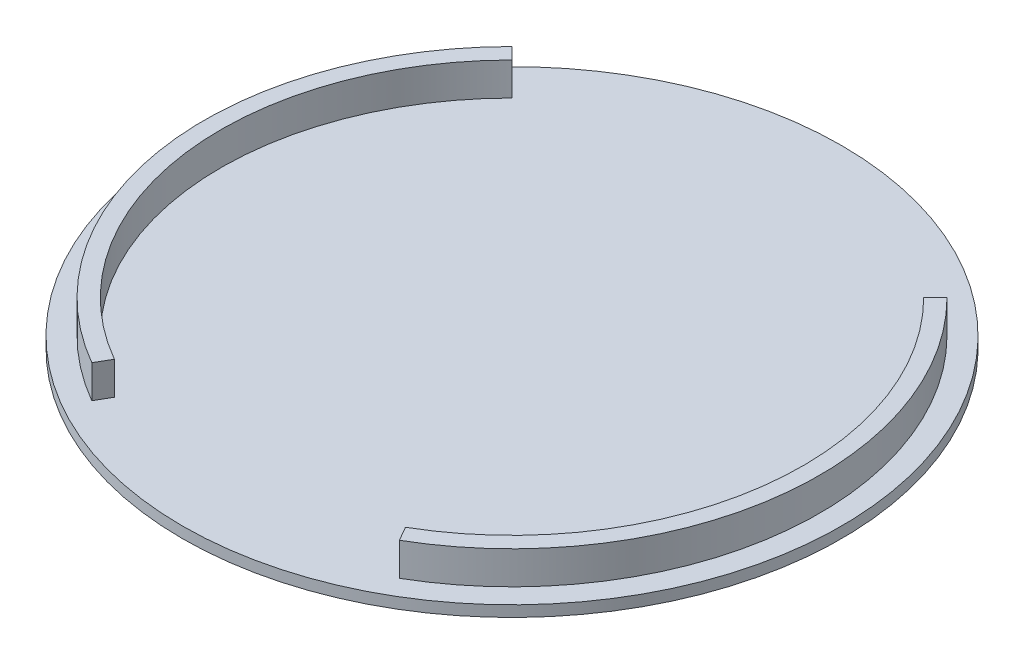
ISO-10303-21;
HEADER;
FILE_DESCRIPTION(('STEP AP214'),'2;1');
FILE_NAME('part.step','',(''),(''),'','','');
FILE_SCHEMA(('AUTOMOTIVE_DESIGN { 1 0 10303 214 1 1 1 1 }'));
ENDSEC;
DATA;
#1=APPLICATION_CONTEXT('core data for automotive mechanical design processes');
#2=APPLICATION_PROTOCOL_DEFINITION('international standard','automotive_design',2000,#1);
#3=PRODUCT_CONTEXT('',#1,'mechanical');
#4=PRODUCT('Part','Part','',(#3));
#5=PRODUCT_RELATED_PRODUCT_CATEGORY('part','',(#4));
#6=PRODUCT_DEFINITION_FORMATION('','',#4);
#7=PRODUCT_DEFINITION_CONTEXT('part definition',#1,'design');
#8=PRODUCT_DEFINITION('design','',#6,#7);
#9=PRODUCT_DEFINITION_SHAPE('','',#8);
#10=(LENGTH_UNIT() NAMED_UNIT(*) SI_UNIT(.MILLI.,.METRE.));
#11=(NAMED_UNIT(*) PLANE_ANGLE_UNIT() SI_UNIT($,.RADIAN.));
#12=(NAMED_UNIT(*) SI_UNIT($,.STERADIAN.) SOLID_ANGLE_UNIT());
#13=UNCERTAINTY_MEASURE_WITH_UNIT(LENGTH_MEASURE(1.E-05),#10,'distance_accuracy_value','');
#14=(GEOMETRIC_REPRESENTATION_CONTEXT(3) GLOBAL_UNCERTAINTY_ASSIGNED_CONTEXT((#13)) GLOBAL_UNIT_ASSIGNED_CONTEXT((#10,
#11,#12)) REPRESENTATION_CONTEXT('',''));
#15=CARTESIAN_POINT('',(0.,0.,0.));
#16=DIRECTION('',(0.,0.,1.));
#17=DIRECTION('',(1.,0.,0.));
#18=AXIS2_PLACEMENT_3D('',#15,#16,#17);
#19=CARTESIAN_POINT('',(0.,2.,0.));
#20=DIRECTION('',(0.,1.,0.));
#21=DIRECTION('',(0.,0.,1.));
#22=AXIS2_PLACEMENT_3D('',#19,#20,#21);
#23=PLANE('',#22);
#24=CARTESIAN_POINT('',(0.,2.,0.));
#25=DIRECTION('',(0.,1.,0.));
#26=DIRECTION('',(0.,0.,1.));
#27=AXIS2_PLACEMENT_3D('',#24,#25,#26);
#28=CIRCLE('',#27,60.);
#29=CARTESIAN_POINT('',(0.,2.,60.));
#30=VERTEX_POINT('',#29);
#31=EDGE_CURVE('E11',#30,#30,#28,.T.);
#32=ORIENTED_EDGE('',*,*,#31,.T.);
#33=EDGE_LOOP('',(#32));
#34=FACE_BOUND('',#33,.T.);
#35=DIRECTION('',(-0.707106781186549,0.,0.707106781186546));
#36=VECTOR('',#35,1.);
#37=CARTESIAN_POINT('',(37.4766594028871,2.,-37.476659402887));
#38=LINE('',#37,#36);
#39=CARTESIAN_POINT('',(39.5979797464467,2.,-39.5979797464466));
#40=VERTEX_POINT('',#39);
#41=CARTESIAN_POINT('',(37.4766594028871,2.,-37.476659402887));
#42=VERTEX_POINT('',#41);
#43=EDGE_CURVE('E369',#40,#42,#38,.T.);
#44=ORIENTED_EDGE('',*,*,#43,.F.);
#45=CARTESIAN_POINT('',(0.,2.,0.));
#46=DIRECTION('',(0.,1.,0.));
#47=DIRECTION('',(0.,0.,-1.));
#48=AXIS2_PLACEMENT_3D('',#45,#46,#47);
#49=CIRCLE('',#48,56.);
#50=CARTESIAN_POINT('',(27.9999999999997,2.,48.4974226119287));
#51=VERTEX_POINT('',#50);
#52=EDGE_CURVE('E355',#51,#40,#49,.T.);
#53=ORIENTED_EDGE('',*,*,#52,.F.);
#54=DIRECTION('',(0.499999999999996,0.,0.866025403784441));
#55=VECTOR('',#54,1.);
#56=CARTESIAN_POINT('',(26.4999999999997,2.,45.8993464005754));
#57=LINE('',#56,#55);
#58=CARTESIAN_POINT('',(26.4999999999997,2.,45.8993464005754));
#59=VERTEX_POINT('',#58);
#60=EDGE_CURVE('E360',#59,#51,#57,.T.);
#61=ORIENTED_EDGE('',*,*,#60,.F.);
#62=CARTESIAN_POINT('',(0.,2.,0.));
#63=DIRECTION('',(0.,-1.,0.));
#64=DIRECTION('',(0.,0.,-1.));
#65=AXIS2_PLACEMENT_3D('',#62,#63,#64);
#66=CIRCLE('',#65,53.);
#67=EDGE_CURVE('E371',#42,#59,#66,.T.);
#68=ORIENTED_EDGE('',*,*,#67,.F.);
#69=EDGE_LOOP('',(#44,#53,#61,#68));
#70=FACE_BOUND('',#69,.T.);
#71=DIRECTION('',(0.499999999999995,0.,-0.866025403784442));
#72=VECTOR('',#71,1.);
#73=CARTESIAN_POINT('',(-27.9999999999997,2.,48.4974226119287));
#74=LINE('',#73,#72);
#75=CARTESIAN_POINT('',(-27.9999999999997,2.,48.4974226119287));
#76=VERTEX_POINT('',#75);
#77=CARTESIAN_POINT('',(-26.4999999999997,2.,45.8993464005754));
#78=VERTEX_POINT('',#77);
#79=EDGE_CURVE('E340',#76,#78,#74,.T.);
#80=ORIENTED_EDGE('',*,*,#79,.F.);
#81=CARTESIAN_POINT('',(0.,2.,0.));
#82=DIRECTION('',(0.,1.,0.));
#83=DIRECTION('',(0.,0.,1.));
#84=AXIS2_PLACEMENT_3D('',#81,#82,#83);
#85=CIRCLE('',#84,56.);
#86=CARTESIAN_POINT('',(-39.5979797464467,2.,-39.5979797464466));
#87=VERTEX_POINT('',#86);
#88=EDGE_CURVE('E320',#87,#76,#85,.T.);
#89=ORIENTED_EDGE('',*,*,#88,.F.);
#90=DIRECTION('',(-0.707106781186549,0.,-0.707106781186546));
#91=VECTOR('',#90,1.);
#92=CARTESIAN_POINT('',(-39.5979797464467,2.,-39.5979797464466));
#93=LINE('',#92,#91);
#94=CARTESIAN_POINT('',(-37.4766594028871,2.,-37.4766594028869));
#95=VERTEX_POINT('',#94);
#96=EDGE_CURVE('E331',#95,#87,#93,.T.);
#97=ORIENTED_EDGE('',*,*,#96,.F.);
#98=CARTESIAN_POINT('',(0.,2.,0.));
#99=DIRECTION('',(0.,-1.,0.));
#100=DIRECTION('',(0.,0.,1.));
#101=AXIS2_PLACEMENT_3D('',#98,#99,#100);
#102=CIRCLE('',#101,53.);
#103=EDGE_CURVE('E342',#78,#95,#102,.T.);
#104=ORIENTED_EDGE('',*,*,#103,.F.);
#105=EDGE_LOOP('',(#80,#89,#97,#104));
#106=FACE_BOUND('',#105,.T.);
#107=ADVANCED_FACE('F33',(#34,#70,#106),#23,.T.);
#108=CARTESIAN_POINT('',(0.,2.,0.));
#109=DIRECTION('',(0.,-1.,0.));
#110=DIRECTION('',(0.,0.,-1.));
#111=AXIS2_PLACEMENT_3D('',#108,#109,#110);
#112=CYLINDRICAL_SURFACE('',#111,60.);
#113=ORIENTED_EDGE('',*,*,#31,.F.);
#114=EDGE_LOOP('',(#113));
#115=FACE_BOUND('',#114,.T.);
#116=CARTESIAN_POINT('',(0.,0.,0.));
#117=DIRECTION('',(0.,1.,0.));
#118=DIRECTION('',(0.,0.,1.));
#119=AXIS2_PLACEMENT_3D('',#116,#117,#118);
#120=CIRCLE('',#119,60.);
#121=CARTESIAN_POINT('',(0.,0.,60.));
#122=VERTEX_POINT('',#121);
#123=EDGE_CURVE('E37',#122,#122,#120,.T.);
#124=ORIENTED_EDGE('',*,*,#123,.T.);
#125=EDGE_LOOP('',(#124));
#126=FACE_BOUND('',#125,.T.);
#127=ADVANCED_FACE('F35',(#115,#126),#112,.T.);
#128=CARTESIAN_POINT('',(0.,0.,0.));
#129=DIRECTION('',(0.,1.,0.));
#130=DIRECTION('',(0.,0.,1.));
#131=AXIS2_PLACEMENT_3D('',#128,#129,#130);
#132=PLANE('',#131);
#133=DIRECTION('',(1.,0.,0.));
#134=VECTOR('',#133,1.);
#135=CARTESIAN_POINT('',(28.,0.,28.));
#136=LINE('',#135,#134);
#137=CARTESIAN_POINT('',(28.,0.,28.));
#138=VERTEX_POINT('',#137);
#139=CARTESIAN_POINT('',(38.,0.,28.));
#140=VERTEX_POINT('',#139);
#141=EDGE_CURVE('E223',#138,#140,#136,.T.);
#142=ORIENTED_EDGE('',*,*,#141,.F.);
#143=DIRECTION('',(0.,0.,-1.));
#144=VECTOR('',#143,1.);
#145=CARTESIAN_POINT('',(28.,0.,38.));
#146=LINE('',#145,#144);
#147=CARTESIAN_POINT('',(28.,0.,38.));
#148=VERTEX_POINT('',#147);
#149=EDGE_CURVE('E48',#148,#138,#146,.T.);
#150=ORIENTED_EDGE('',*,*,#149,.F.);
#151=DIRECTION('',(-1.,0.,0.));
#152=VECTOR('',#151,1.);
#153=CARTESIAN_POINT('',(28.,0.,38.));
#154=LINE('',#153,#152);
#155=CARTESIAN_POINT('',(38.,0.,38.));
#156=VERTEX_POINT('',#155);
#157=EDGE_CURVE('E214',#156,#148,#154,.T.);
#158=ORIENTED_EDGE('',*,*,#157,.F.);
#159=DIRECTION('',(0.,0.,1.));
#160=VECTOR('',#159,1.);
#161=CARTESIAN_POINT('',(38.,0.,38.));
#162=LINE('',#161,#160);
#163=EDGE_CURVE('E217',#140,#156,#162,.T.);
#164=ORIENTED_EDGE('',*,*,#163,.F.);
#165=EDGE_LOOP('',(#142,#150,#158,#164));
#166=FACE_BOUND('',#165,.T.);
#167=DIRECTION('',(-1.,0.,0.));
#168=VECTOR('',#167,1.);
#169=CARTESIAN_POINT('',(38.,0.,-28.));
#170=LINE('',#169,#168);
#171=CARTESIAN_POINT('',(38.,0.,-28.));
#172=VERTEX_POINT('',#171);
#173=CARTESIAN_POINT('',(28.,0.,-28.));
#174=VERTEX_POINT('',#173);
#175=EDGE_CURVE('E249',#172,#174,#170,.T.);
#176=ORIENTED_EDGE('',*,*,#175,.F.);
#177=DIRECTION('',(0.,0.,1.));
#178=VECTOR('',#177,1.);
#179=CARTESIAN_POINT('',(38.,0.,-28.));
#180=LINE('',#179,#178);
#181=CARTESIAN_POINT('',(38.,0.,-38.));
#182=VERTEX_POINT('',#181);
#183=EDGE_CURVE('E56',#182,#172,#180,.T.);
#184=ORIENTED_EDGE('',*,*,#183,.F.);
#185=DIRECTION('',(1.,0.,0.));
#186=VECTOR('',#185,1.);
#187=CARTESIAN_POINT('',(38.,0.,-38.));
#188=LINE('',#187,#186);
#189=CARTESIAN_POINT('',(28.,0.,-38.));
#190=VERTEX_POINT('',#189);
#191=EDGE_CURVE('E238',#190,#182,#188,.T.);
#192=ORIENTED_EDGE('',*,*,#191,.F.);
#193=DIRECTION('',(0.,0.,-1.));
#194=VECTOR('',#193,1.);
#195=CARTESIAN_POINT('',(28.,0.,-28.));
#196=LINE('',#195,#194);
#197=EDGE_CURVE('E253',#174,#190,#196,.T.);
#198=ORIENTED_EDGE('',*,*,#197,.F.);
#199=EDGE_LOOP('',(#176,#184,#192,#198));
#200=FACE_BOUND('',#199,.T.);
#201=DIRECTION('',(-1.,0.,0.));
#202=VECTOR('',#201,1.);
#203=CARTESIAN_POINT('',(-28.,0.,-28.));
#204=LINE('',#203,#202);
#205=CARTESIAN_POINT('',(-28.,0.,-28.));
#206=VERTEX_POINT('',#205);
#207=CARTESIAN_POINT('',(-38.,0.,-28.));
#208=VERTEX_POINT('',#207);
#209=EDGE_CURVE('E280',#206,#208,#204,.T.);
#210=ORIENTED_EDGE('',*,*,#209,.F.);
#211=DIRECTION('',(0.,0.,1.));
#212=VECTOR('',#211,1.);
#213=CARTESIAN_POINT('',(-28.,0.,-38.));
#214=LINE('',#213,#212);
#215=CARTESIAN_POINT('',(-28.,0.,-38.));
#216=VERTEX_POINT('',#215);
#217=EDGE_CURVE('E278',#216,#206,#214,.T.);
#218=ORIENTED_EDGE('',*,*,#217,.F.);
#219=DIRECTION('',(1.,0.,0.));
#220=VECTOR('',#219,1.);
#221=CARTESIAN_POINT('',(-28.,0.,-38.));
#222=LINE('',#221,#220);
#223=CARTESIAN_POINT('',(-38.,0.,-38.));
#224=VERTEX_POINT('',#223);
#225=EDGE_CURVE('E268',#224,#216,#222,.T.);
#226=ORIENTED_EDGE('',*,*,#225,.F.);
#227=DIRECTION('',(0.,0.,-1.));
#228=VECTOR('',#227,1.);
#229=CARTESIAN_POINT('',(-38.,0.,-38.));
#230=LINE('',#229,#228);
#231=EDGE_CURVE('E283',#208,#224,#230,.T.);
#232=ORIENTED_EDGE('',*,*,#231,.F.);
#233=EDGE_LOOP('',(#210,#218,#226,#232));
#234=FACE_BOUND('',#233,.T.);
#235=DIRECTION('',(1.,0.,0.));
#236=VECTOR('',#235,1.);
#237=CARTESIAN_POINT('',(-38.,0.,28.));
#238=LINE('',#237,#236);
#239=CARTESIAN_POINT('',(-38.,0.,28.));
#240=VERTEX_POINT('',#239);
#241=CARTESIAN_POINT('',(-28.,0.,28.));
#242=VERTEX_POINT('',#241);
#243=EDGE_CURVE('E310',#240,#242,#238,.T.);
#244=ORIENTED_EDGE('',*,*,#243,.F.);
#245=DIRECTION('',(0.,0.,-1.));
#246=VECTOR('',#245,1.);
#247=CARTESIAN_POINT('',(-38.,0.,38.));
#248=LINE('',#247,#246);
#249=CARTESIAN_POINT('',(-38.,0.,38.));
#250=VERTEX_POINT('',#249);
#251=EDGE_CURVE('E230',#250,#240,#248,.T.);
#252=ORIENTED_EDGE('',*,*,#251,.F.);
#253=DIRECTION('',(-1.,0.,0.));
#254=VECTOR('',#253,1.);
#255=CARTESIAN_POINT('',(-38.,0.,38.));
#256=LINE('',#255,#254);
#257=CARTESIAN_POINT('',(-28.,0.,38.));
#258=VERTEX_POINT('',#257);
#259=EDGE_CURVE('E299',#258,#250,#256,.T.);
#260=ORIENTED_EDGE('',*,*,#259,.F.);
#261=DIRECTION('',(0.,0.,1.));
#262=VECTOR('',#261,1.);
#263=CARTESIAN_POINT('',(-28.,0.,38.));
#264=LINE('',#263,#262);
#265=EDGE_CURVE('E313',#242,#258,#264,.T.);
#266=ORIENTED_EDGE('',*,*,#265,.F.);
#267=EDGE_LOOP('',(#244,#252,#260,#266));
#268=FACE_BOUND('',#267,.T.);
#269=ORIENTED_EDGE('',*,*,#123,.F.);
#270=EDGE_LOOP('',(#269));
#271=FACE_BOUND('',#270,.T.);
#272=ADVANCED_FACE('F389',(#166,#200,#234,#268,#271),#132,.F.);
#273=CARTESIAN_POINT('',(0.,8.,0.));
#274=DIRECTION('',(0.,-1.,0.));
#275=DIRECTION('',(0.,0.,-1.));
#276=AXIS2_PLACEMENT_3D('',#273,#274,#275);
#277=CYLINDRICAL_SURFACE('',#276,56.);
#278=ORIENTED_EDGE('',*,*,#52,.T.);
#279=DIRECTION('',(0.,-1.,0.));
#280=VECTOR('',#279,1.);
#281=CARTESIAN_POINT('',(39.5979797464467,8.,-39.5979797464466));
#282=LINE('',#281,#280);
#283=CARTESIAN_POINT('',(39.5979797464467,8.,-39.5979797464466));
#284=VERTEX_POINT('',#283);
#285=EDGE_CURVE('E382',#284,#40,#282,.T.);
#286=ORIENTED_EDGE('',*,*,#285,.F.);
#287=CARTESIAN_POINT('',(0.,8.,0.));
#288=DIRECTION('',(0.,1.,0.));
#289=DIRECTION('',(0.,0.,-1.));
#290=AXIS2_PLACEMENT_3D('',#287,#288,#289);
#291=CIRCLE('',#290,56.);
#292=CARTESIAN_POINT('',(27.9999999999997,8.,48.4974226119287));
#293=VERTEX_POINT('',#292);
#294=EDGE_CURVE('E356',#293,#284,#291,.T.);
#295=ORIENTED_EDGE('',*,*,#294,.F.);
#296=DIRECTION('',(0.,-1.,0.));
#297=VECTOR('',#296,1.);
#298=CARTESIAN_POINT('',(27.9999999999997,8.,48.4974226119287));
#299=LINE('',#298,#297);
#300=EDGE_CURVE('E366',#293,#51,#299,.T.);
#301=ORIENTED_EDGE('',*,*,#300,.T.);
#302=EDGE_LOOP('',(#278,#286,#295,#301));
#303=FACE_BOUND('',#302,.T.);
#304=ADVANCED_FACE('F391',(#303),#277,.T.);
#305=CARTESIAN_POINT('',(37.4766594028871,8.,-37.476659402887));
#306=DIRECTION('',(0.707106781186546,0.,0.707106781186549));
#307=DIRECTION('',(0.707106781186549,0.,-0.707106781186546));
#308=AXIS2_PLACEMENT_3D('',#305,#306,#307);
#309=PLANE('',#308);
#310=ORIENTED_EDGE('',*,*,#43,.T.);
#311=DIRECTION('',(0.,-1.,0.));
#312=VECTOR('',#311,1.);
#313=CARTESIAN_POINT('',(37.4766594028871,8.,-37.476659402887));
#314=LINE('',#313,#312);
#315=CARTESIAN_POINT('',(37.4766594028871,8.,-37.476659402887));
#316=VERTEX_POINT('',#315);
#317=EDGE_CURVE('E379',#316,#42,#314,.T.);
#318=ORIENTED_EDGE('',*,*,#317,.F.);
#319=DIRECTION('',(-0.707106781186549,0.,0.707106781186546));
#320=VECTOR('',#319,1.);
#321=CARTESIAN_POINT('',(37.4766594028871,8.,-37.476659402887));
#322=LINE('',#321,#320);
#323=EDGE_CURVE('E359',#284,#316,#322,.T.);
#324=ORIENTED_EDGE('',*,*,#323,.F.);
#325=ORIENTED_EDGE('',*,*,#285,.T.);
#326=EDGE_LOOP('',(#310,#318,#324,#325));
#327=FACE_BOUND('',#326,.T.);
#328=ADVANCED_FACE('F397',(#327),#309,.F.);
#329=CARTESIAN_POINT('',(0.,8.,0.));
#330=DIRECTION('',(0.,-1.,0.));
#331=DIRECTION('',(0.,0.,-1.));
#332=AXIS2_PLACEMENT_3D('',#329,#330,#331);
#333=CYLINDRICAL_SURFACE('',#332,53.);
#334=ORIENTED_EDGE('',*,*,#67,.T.);
#335=DIRECTION('',(0.,-1.,0.));
#336=VECTOR('',#335,1.);
#337=CARTESIAN_POINT('',(26.4999999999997,8.,45.8993464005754));
#338=LINE('',#337,#336);
#339=CARTESIAN_POINT('',(26.4999999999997,8.,45.8993464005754));
#340=VERTEX_POINT('',#339);
#341=EDGE_CURVE('E377',#340,#59,#338,.T.);
#342=ORIENTED_EDGE('',*,*,#341,.F.);
#343=CARTESIAN_POINT('',(0.,8.,0.));
#344=DIRECTION('',(0.,-1.,0.));
#345=DIRECTION('',(0.,0.,-1.));
#346=AXIS2_PLACEMENT_3D('',#343,#344,#345);
#347=CIRCLE('',#346,53.);
#348=EDGE_CURVE('E362',#316,#340,#347,.T.);
#349=ORIENTED_EDGE('',*,*,#348,.F.);
#350=ORIENTED_EDGE('',*,*,#317,.T.);
#351=EDGE_LOOP('',(#334,#342,#349,#350));
#352=FACE_BOUND('',#351,.T.);
#353=ADVANCED_FACE('F411',(#352),#333,.F.);
#354=CARTESIAN_POINT('',(26.4999999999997,8.,45.8993464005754));
#355=DIRECTION('',(0.866025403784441,0.,-0.499999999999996));
#356=DIRECTION('',(-0.499999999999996,0.,-0.866025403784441));
#357=AXIS2_PLACEMENT_3D('',#354,#355,#356);
#358=PLANE('',#357);
#359=ORIENTED_EDGE('',*,*,#60,.T.);
#360=ORIENTED_EDGE('',*,*,#300,.F.);
#361=DIRECTION('',(0.499999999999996,0.,0.866025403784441));
#362=VECTOR('',#361,1.);
#363=CARTESIAN_POINT('',(26.4999999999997,8.,45.8993464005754));
#364=LINE('',#363,#362);
#365=EDGE_CURVE('E364',#340,#293,#364,.T.);
#366=ORIENTED_EDGE('',*,*,#365,.F.);
#367=ORIENTED_EDGE('',*,*,#341,.T.);
#368=EDGE_LOOP('',(#359,#360,#366,#367));
#369=FACE_BOUND('',#368,.T.);
#370=ADVANCED_FACE('F414',(#369),#358,.F.);
#371=CARTESIAN_POINT('',(0.,8.,0.));
#372=DIRECTION('',(0.,-1.,0.));
#373=DIRECTION('',(0.,0.,-1.));
#374=AXIS2_PLACEMENT_3D('',#371,#372,#373);
#375=PLANE('',#374);
#376=ORIENTED_EDGE('',*,*,#294,.T.);
#377=ORIENTED_EDGE('',*,*,#323,.T.);
#378=ORIENTED_EDGE('',*,*,#348,.T.);
#379=ORIENTED_EDGE('',*,*,#365,.T.);
#380=EDGE_LOOP('',(#376,#377,#378,#379));
#381=FACE_BOUND('',#380,.T.);
#382=ADVANCED_FACE('F418',(#381),#375,.F.);
#383=CARTESIAN_POINT('',(0.,8.,0.));
#384=DIRECTION('',(0.,-1.,0.));
#385=DIRECTION('',(0.,0.,-1.));
#386=AXIS2_PLACEMENT_3D('',#383,#384,#385);
#387=CYLINDRICAL_SURFACE('',#386,56.);
#388=ORIENTED_EDGE('',*,*,#88,.T.);
#389=DIRECTION('',(0.,-1.,0.));
#390=VECTOR('',#389,1.);
#391=CARTESIAN_POINT('',(-27.9999999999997,8.,48.4974226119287));
#392=LINE('',#391,#390);
#393=CARTESIAN_POINT('',(-27.9999999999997,8.,48.4974226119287));
#394=VERTEX_POINT('',#393);
#395=EDGE_CURVE('E353',#394,#76,#392,.T.);
#396=ORIENTED_EDGE('',*,*,#395,.F.);
#397=CARTESIAN_POINT('',(0.,8.,0.));
#398=DIRECTION('',(0.,1.,0.));
#399=DIRECTION('',(0.,0.,1.));
#400=AXIS2_PLACEMENT_3D('',#397,#398,#399);
#401=CIRCLE('',#400,56.);
#402=CARTESIAN_POINT('',(-39.5979797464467,8.,-39.5979797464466));
#403=VERTEX_POINT('',#402);
#404=EDGE_CURVE('E327',#403,#394,#401,.T.);
#405=ORIENTED_EDGE('',*,*,#404,.F.);
#406=DIRECTION('',(0.,-1.,0.));
#407=VECTOR('',#406,1.);
#408=CARTESIAN_POINT('',(-39.5979797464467,8.,-39.5979797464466));
#409=LINE('',#408,#407);
#410=EDGE_CURVE('E337',#403,#87,#409,.T.);
#411=ORIENTED_EDGE('',*,*,#410,.T.);
#412=EDGE_LOOP('',(#388,#396,#405,#411));
#413=FACE_BOUND('',#412,.T.);
#414=ADVANCED_FACE('F422',(#413),#387,.T.);
#415=CARTESIAN_POINT('',(-27.9999999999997,8.,48.4974226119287));
#416=DIRECTION('',(-0.866025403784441,0.,-0.499999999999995));
#417=DIRECTION('',(-0.499999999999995,0.,0.866025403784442));
#418=AXIS2_PLACEMENT_3D('',#415,#416,#417);
#419=PLANE('',#418);
#420=ORIENTED_EDGE('',*,*,#79,.T.);
#421=DIRECTION('',(0.,-1.,0.));
#422=VECTOR('',#421,1.);
#423=CARTESIAN_POINT('',(-26.4999999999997,8.,45.8993464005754));
#424=LINE('',#423,#422);
#425=CARTESIAN_POINT('',(-26.4999999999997,8.,45.8993464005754));
#426=VERTEX_POINT('',#425);
#427=EDGE_CURVE('E350',#426,#78,#424,.T.);
#428=ORIENTED_EDGE('',*,*,#427,.F.);
#429=DIRECTION('',(0.499999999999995,0.,-0.866025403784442));
#430=VECTOR('',#429,1.);
#431=CARTESIAN_POINT('',(-27.9999999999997,8.,48.4974226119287));
#432=LINE('',#431,#430);
#433=EDGE_CURVE('E330',#394,#426,#432,.T.);
#434=ORIENTED_EDGE('',*,*,#433,.F.);
#435=ORIENTED_EDGE('',*,*,#395,.T.);
#436=EDGE_LOOP('',(#420,#428,#434,#435));
#437=FACE_BOUND('',#436,.T.);
#438=ADVANCED_FACE('F426',(#437),#419,.F.);
#439=CARTESIAN_POINT('',(0.,8.,0.));
#440=DIRECTION('',(0.,-1.,0.));
#441=DIRECTION('',(0.,0.,-1.));
#442=AXIS2_PLACEMENT_3D('',#439,#440,#441);
#443=CYLINDRICAL_SURFACE('',#442,53.);
#444=ORIENTED_EDGE('',*,*,#103,.T.);
#445=DIRECTION('',(0.,-1.,0.));
#446=VECTOR('',#445,1.);
#447=CARTESIAN_POINT('',(-37.4766594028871,8.,-37.4766594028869));
#448=LINE('',#447,#446);
#449=CARTESIAN_POINT('',(-37.4766594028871,8.,-37.4766594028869));
#450=VERTEX_POINT('',#449);
#451=EDGE_CURVE('E348',#450,#95,#448,.T.);
#452=ORIENTED_EDGE('',*,*,#451,.F.);
#453=CARTESIAN_POINT('',(0.,8.,0.));
#454=DIRECTION('',(0.,-1.,0.));
#455=DIRECTION('',(0.,0.,1.));
#456=AXIS2_PLACEMENT_3D('',#453,#454,#455);
#457=CIRCLE('',#456,53.);
#458=EDGE_CURVE('E333',#426,#450,#457,.T.);
#459=ORIENTED_EDGE('',*,*,#458,.F.);
#460=ORIENTED_EDGE('',*,*,#427,.T.);
#461=EDGE_LOOP('',(#444,#452,#459,#460));
#462=FACE_BOUND('',#461,.T.);
#463=ADVANCED_FACE('F430',(#462),#443,.F.);
#464=CARTESIAN_POINT('',(-39.5979797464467,8.,-39.5979797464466));
#465=DIRECTION('',(-0.707106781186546,0.,0.707106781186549));
#466=DIRECTION('',(0.707106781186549,0.,0.707106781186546));
#467=AXIS2_PLACEMENT_3D('',#464,#465,#466);
#468=PLANE('',#467);
#469=ORIENTED_EDGE('',*,*,#96,.T.);
#470=ORIENTED_EDGE('',*,*,#410,.F.);
#471=DIRECTION('',(-0.707106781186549,0.,-0.707106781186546));
#472=VECTOR('',#471,1.);
#473=CARTESIAN_POINT('',(-39.5979797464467,8.,-39.5979797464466));
#474=LINE('',#473,#472);
#475=EDGE_CURVE('E335',#450,#403,#474,.T.);
#476=ORIENTED_EDGE('',*,*,#475,.F.);
#477=ORIENTED_EDGE('',*,*,#451,.T.);
#478=EDGE_LOOP('',(#469,#470,#476,#477));
#479=FACE_BOUND('',#478,.T.);
#480=ADVANCED_FACE('F434',(#479),#468,.F.);
#481=CARTESIAN_POINT('',(0.,8.,0.));
#482=DIRECTION('',(0.,1.,0.));
#483=DIRECTION('',(0.,0.,1.));
#484=AXIS2_PLACEMENT_3D('',#481,#482,#483);
#485=PLANE('',#484);
#486=ORIENTED_EDGE('',*,*,#404,.T.);
#487=ORIENTED_EDGE('',*,*,#433,.T.);
#488=ORIENTED_EDGE('',*,*,#458,.T.);
#489=ORIENTED_EDGE('',*,*,#475,.T.);
#490=EDGE_LOOP('',(#486,#487,#488,#489));
#491=FACE_BOUND('',#490,.T.);
#492=ADVANCED_FACE('F438',(#491),#485,.T.);
#493=CARTESIAN_POINT('',(-38.,1.,38.));
#494=DIRECTION('',(-1.,0.,0.));
#495=DIRECTION('',(0.,0.,1.));
#496=AXIS2_PLACEMENT_3D('',#493,#494,#495);
#497=PLANE('',#496);
#498=ORIENTED_EDGE('',*,*,#251,.T.);
#499=DIRECTION('',(0.,-1.,0.));
#500=VECTOR('',#499,1.);
#501=CARTESIAN_POINT('',(-38.,1.,28.));
#502=LINE('',#501,#500);
#503=CARTESIAN_POINT('',(-38.,1.,28.));
#504=VERTEX_POINT('',#503);
#505=EDGE_CURVE('E308',#504,#240,#502,.T.);
#506=ORIENTED_EDGE('',*,*,#505,.F.);
#507=DIRECTION('',(0.,0.,-1.));
#508=VECTOR('',#507,1.);
#509=CARTESIAN_POINT('',(-38.,1.,38.));
#510=LINE('',#509,#508);
#511=CARTESIAN_POINT('',(-38.,1.,38.));
#512=VERTEX_POINT('',#511);
#513=EDGE_CURVE('E295',#512,#504,#510,.T.);
#514=ORIENTED_EDGE('',*,*,#513,.F.);
#515=DIRECTION('',(0.,-1.,0.));
#516=VECTOR('',#515,1.);
#517=CARTESIAN_POINT('',(-38.,1.,38.));
#518=LINE('',#517,#516);
#519=EDGE_CURVE('E318',#512,#250,#518,.T.);
#520=ORIENTED_EDGE('',*,*,#519,.T.);
#521=EDGE_LOOP('',(#498,#506,#514,#520));
#522=FACE_BOUND('',#521,.T.);
#523=ADVANCED_FACE('F442',(#522),#497,.F.);
#524=CARTESIAN_POINT('',(-38.,1.,38.));
#525=DIRECTION('',(0.,0.,1.));
#526=DIRECTION('',(1.,0.,0.));
#527=AXIS2_PLACEMENT_3D('',#524,#525,#526);
#528=PLANE('',#527);
#529=ORIENTED_EDGE('',*,*,#259,.T.);
#530=ORIENTED_EDGE('',*,*,#519,.F.);
#531=DIRECTION('',(-1.,0.,0.));
#532=VECTOR('',#531,1.);
#533=CARTESIAN_POINT('',(-38.,1.,38.));
#534=LINE('',#533,#532);
#535=CARTESIAN_POINT('',(-28.,1.,38.));
#536=VERTEX_POINT('',#535);
#537=EDGE_CURVE('E305',#536,#512,#534,.T.);
#538=ORIENTED_EDGE('',*,*,#537,.F.);
#539=DIRECTION('',(0.,-1.,0.));
#540=VECTOR('',#539,1.);
#541=CARTESIAN_POINT('',(-28.,1.,38.));
#542=LINE('',#541,#540);
#543=EDGE_CURVE('E321',#536,#258,#542,.T.);
#544=ORIENTED_EDGE('',*,*,#543,.T.);
#545=EDGE_LOOP('',(#529,#530,#538,#544));
#546=FACE_BOUND('',#545,.T.);
#547=ADVANCED_FACE('F446',(#546),#528,.F.);
#548=CARTESIAN_POINT('',(-28.,1.,38.));
#549=DIRECTION('',(1.,0.,0.));
#550=DIRECTION('',(0.,0.,-1.));
#551=AXIS2_PLACEMENT_3D('',#548,#549,#550);
#552=PLANE('',#551);
#553=ORIENTED_EDGE('',*,*,#265,.T.);
#554=ORIENTED_EDGE('',*,*,#543,.F.);
#555=DIRECTION('',(0.,0.,1.));
#556=VECTOR('',#555,1.);
#557=CARTESIAN_POINT('',(-28.,1.,38.));
#558=LINE('',#557,#556);
#559=CARTESIAN_POINT('',(-28.,1.,28.));
#560=VERTEX_POINT('',#559);
#561=EDGE_CURVE('E302',#560,#536,#558,.T.);
#562=ORIENTED_EDGE('',*,*,#561,.F.);
#563=DIRECTION('',(0.,-1.,0.));
#564=VECTOR('',#563,1.);
#565=CARTESIAN_POINT('',(-28.,1.,28.));
#566=LINE('',#565,#564);
#567=EDGE_CURVE('E323',#560,#242,#566,.T.);
#568=ORIENTED_EDGE('',*,*,#567,.T.);
#569=EDGE_LOOP('',(#553,#554,#562,#568));
#570=FACE_BOUND('',#569,.T.);
#571=ADVANCED_FACE('F452',(#570),#552,.F.);
#572=CARTESIAN_POINT('',(-38.,1.,28.));
#573=DIRECTION('',(0.,0.,-1.));
#574=DIRECTION('',(-1.,0.,0.));
#575=AXIS2_PLACEMENT_3D('',#572,#573,#574);
#576=PLANE('',#575);
#577=ORIENTED_EDGE('',*,*,#243,.T.);
#578=ORIENTED_EDGE('',*,*,#567,.F.);
#579=DIRECTION('',(1.,0.,0.));
#580=VECTOR('',#579,1.);
#581=CARTESIAN_POINT('',(-38.,1.,28.));
#582=LINE('',#581,#580);
#583=EDGE_CURVE('E298',#504,#560,#582,.T.);
#584=ORIENTED_EDGE('',*,*,#583,.F.);
#585=ORIENTED_EDGE('',*,*,#505,.T.);
#586=EDGE_LOOP('',(#577,#578,#584,#585));
#587=FACE_BOUND('',#586,.T.);
#588=ADVANCED_FACE('F448',(#587),#576,.F.);
#589=CARTESIAN_POINT('',(0.,1.,0.));
#590=DIRECTION('',(0.,-1.,0.));
#591=DIRECTION('',(0.,0.,-1.));
#592=AXIS2_PLACEMENT_3D('',#589,#590,#591);
#593=PLANE('',#592);
#594=ORIENTED_EDGE('',*,*,#513,.T.);
#595=ORIENTED_EDGE('',*,*,#583,.T.);
#596=ORIENTED_EDGE('',*,*,#561,.T.);
#597=ORIENTED_EDGE('',*,*,#537,.T.);
#598=EDGE_LOOP('',(#594,#595,#596,#597));
#599=FACE_BOUND('',#598,.T.);
#600=ADVANCED_FACE('F451',(#599),#593,.T.);
#601=CARTESIAN_POINT('',(-28.,1.,-38.));
#602=DIRECTION('',(1.,0.,0.));
#603=DIRECTION('',(0.,0.,-1.));
#604=AXIS2_PLACEMENT_3D('',#601,#602,#603);
#605=PLANE('',#604);
#606=ORIENTED_EDGE('',*,*,#217,.T.);
#607=DIRECTION('',(0.,-1.,0.));
#608=VECTOR('',#607,1.);
#609=CARTESIAN_POINT('',(-28.,1.,-28.));
#610=LINE('',#609,#608);
#611=CARTESIAN_POINT('',(-28.,1.,-28.));
#612=VERTEX_POINT('',#611);
#613=EDGE_CURVE('E277',#612,#206,#610,.T.);
#614=ORIENTED_EDGE('',*,*,#613,.F.);
#615=DIRECTION('',(0.,0.,1.));
#616=VECTOR('',#615,1.);
#617=CARTESIAN_POINT('',(-28.,1.,-38.));
#618=LINE('',#617,#616);
#619=CARTESIAN_POINT('',(-28.,1.,-38.));
#620=VERTEX_POINT('',#619);
#621=EDGE_CURVE('E264',#620,#612,#618,.T.);
#622=ORIENTED_EDGE('',*,*,#621,.F.);
#623=DIRECTION('',(0.,-1.,0.));
#624=VECTOR('',#623,1.);
#625=CARTESIAN_POINT('',(-28.,1.,-38.));
#626=LINE('',#625,#624);
#627=EDGE_CURVE('E250',#620,#216,#626,.T.);
#628=ORIENTED_EDGE('',*,*,#627,.T.);
#629=EDGE_LOOP('',(#606,#614,#622,#628));
#630=FACE_BOUND('',#629,.T.);
#631=ADVANCED_FACE('F462',(#630),#605,.F.);
#632=CARTESIAN_POINT('',(-28.,1.,-38.));
#633=DIRECTION('',(0.,0.,-1.));
#634=DIRECTION('',(-1.,0.,0.));
#635=AXIS2_PLACEMENT_3D('',#632,#633,#634);
#636=PLANE('',#635);
#637=ORIENTED_EDGE('',*,*,#225,.T.);
#638=ORIENTED_EDGE('',*,*,#627,.F.);
#639=DIRECTION('',(1.,0.,0.));
#640=VECTOR('',#639,1.);
#641=CARTESIAN_POINT('',(-28.,1.,-38.));
#642=LINE('',#641,#640);
#643=CARTESIAN_POINT('',(-38.,1.,-38.));
#644=VERTEX_POINT('',#643);
#645=EDGE_CURVE('E274',#644,#620,#642,.T.);
#646=ORIENTED_EDGE('',*,*,#645,.F.);
#647=DIRECTION('',(0.,-1.,0.));
#648=VECTOR('',#647,1.);
#649=CARTESIAN_POINT('',(-38.,1.,-38.));
#650=LINE('',#649,#648);
#651=EDGE_CURVE('E289',#644,#224,#650,.T.);
#652=ORIENTED_EDGE('',*,*,#651,.T.);
#653=EDGE_LOOP('',(#637,#638,#646,#652));
#654=FACE_BOUND('',#653,.T.);
#655=ADVANCED_FACE('F466',(#654),#636,.F.);
#656=CARTESIAN_POINT('',(-38.,1.,-38.));
#657=DIRECTION('',(-1.,0.,0.));
#658=DIRECTION('',(0.,0.,1.));
#659=AXIS2_PLACEMENT_3D('',#656,#657,#658);
#660=PLANE('',#659);
#661=ORIENTED_EDGE('',*,*,#231,.T.);
#662=ORIENTED_EDGE('',*,*,#651,.F.);
#663=DIRECTION('',(0.,0.,-1.));
#664=VECTOR('',#663,1.);
#665=CARTESIAN_POINT('',(-38.,1.,-38.));
#666=LINE('',#665,#664);
#667=CARTESIAN_POINT('',(-38.,1.,-28.));
#668=VERTEX_POINT('',#667);
#669=EDGE_CURVE('E271',#668,#644,#666,.T.);
#670=ORIENTED_EDGE('',*,*,#669,.F.);
#671=DIRECTION('',(0.,-1.,0.));
#672=VECTOR('',#671,1.);
#673=CARTESIAN_POINT('',(-38.,1.,-28.));
#674=LINE('',#673,#672);
#675=EDGE_CURVE('E291',#668,#208,#674,.T.);
#676=ORIENTED_EDGE('',*,*,#675,.T.);
#677=EDGE_LOOP('',(#661,#662,#670,#676));
#678=FACE_BOUND('',#677,.T.);
#679=ADVANCED_FACE('F472',(#678),#660,.F.);
#680=CARTESIAN_POINT('',(-28.,1.,-28.));
#681=DIRECTION('',(0.,0.,1.));
#682=DIRECTION('',(1.,0.,0.));
#683=AXIS2_PLACEMENT_3D('',#680,#681,#682);
#684=PLANE('',#683);
#685=ORIENTED_EDGE('',*,*,#209,.T.);
#686=ORIENTED_EDGE('',*,*,#675,.F.);
#687=DIRECTION('',(-1.,0.,0.));
#688=VECTOR('',#687,1.);
#689=CARTESIAN_POINT('',(-28.,1.,-28.));
#690=LINE('',#689,#688);
#691=EDGE_CURVE('E267',#612,#668,#690,.T.);
#692=ORIENTED_EDGE('',*,*,#691,.F.);
#693=ORIENTED_EDGE('',*,*,#613,.T.);
#694=EDGE_LOOP('',(#685,#686,#692,#693));
#695=FACE_BOUND('',#694,.T.);
#696=ADVANCED_FACE('F468',(#695),#684,.F.);
#697=CARTESIAN_POINT('',(0.,1.,0.));
#698=DIRECTION('',(0.,-1.,0.));
#699=DIRECTION('',(0.,0.,-1.));
#700=AXIS2_PLACEMENT_3D('',#697,#698,#699);
#701=PLANE('',#700);
#702=ORIENTED_EDGE('',*,*,#621,.T.);
#703=ORIENTED_EDGE('',*,*,#691,.T.);
#704=ORIENTED_EDGE('',*,*,#669,.T.);
#705=ORIENTED_EDGE('',*,*,#645,.T.);
#706=EDGE_LOOP('',(#702,#703,#704,#705));
#707=FACE_BOUND('',#706,.T.);
#708=ADVANCED_FACE('F471',(#707),#701,.T.);
#709=CARTESIAN_POINT('',(38.,1.,-28.));
#710=DIRECTION('',(1.,0.,0.));
#711=DIRECTION('',(0.,0.,-1.));
#712=AXIS2_PLACEMENT_3D('',#709,#710,#711);
#713=PLANE('',#712);
#714=ORIENTED_EDGE('',*,*,#183,.T.);
#715=DIRECTION('',(0.,-1.,0.));
#716=VECTOR('',#715,1.);
#717=CARTESIAN_POINT('',(38.,1.,-28.));
#718=LINE('',#717,#716);
#719=CARTESIAN_POINT('',(38.,1.,-28.));
#720=VERTEX_POINT('',#719);
#721=EDGE_CURVE('E247',#720,#172,#718,.T.);
#722=ORIENTED_EDGE('',*,*,#721,.F.);
#723=DIRECTION('',(0.,0.,1.));
#724=VECTOR('',#723,1.);
#725=CARTESIAN_POINT('',(38.,1.,-28.));
#726=LINE('',#725,#724);
#727=CARTESIAN_POINT('',(38.,1.,-38.));
#728=VERTEX_POINT('',#727);
#729=EDGE_CURVE('E234',#728,#720,#726,.T.);
#730=ORIENTED_EDGE('',*,*,#729,.F.);
#731=DIRECTION('',(0.,-1.,0.));
#732=VECTOR('',#731,1.);
#733=CARTESIAN_POINT('',(38.,1.,-38.));
#734=LINE('',#733,#732);
#735=EDGE_CURVE('E224',#728,#182,#734,.T.);
#736=ORIENTED_EDGE('',*,*,#735,.T.);
#737=EDGE_LOOP('',(#714,#722,#730,#736));
#738=FACE_BOUND('',#737,.T.);
#739=ADVANCED_FACE('F482',(#738),#713,.F.);
#740=CARTESIAN_POINT('',(38.,1.,-38.));
#741=DIRECTION('',(0.,0.,-1.));
#742=DIRECTION('',(-1.,0.,0.));
#743=AXIS2_PLACEMENT_3D('',#740,#741,#742);
#744=PLANE('',#743);
#745=ORIENTED_EDGE('',*,*,#191,.T.);
#746=ORIENTED_EDGE('',*,*,#735,.F.);
#747=DIRECTION('',(1.,0.,0.));
#748=VECTOR('',#747,1.);
#749=CARTESIAN_POINT('',(38.,1.,-38.));
#750=LINE('',#749,#748);
#751=CARTESIAN_POINT('',(28.,1.,-38.));
#752=VERTEX_POINT('',#751);
#753=EDGE_CURVE('E244',#752,#728,#750,.T.);
#754=ORIENTED_EDGE('',*,*,#753,.F.);
#755=DIRECTION('',(0.,-1.,0.));
#756=VECTOR('',#755,1.);
#757=CARTESIAN_POINT('',(28.,1.,-38.));
#758=LINE('',#757,#756);
#759=EDGE_CURVE('E259',#752,#190,#758,.T.);
#760=ORIENTED_EDGE('',*,*,#759,.T.);
#761=EDGE_LOOP('',(#745,#746,#754,#760));
#762=FACE_BOUND('',#761,.T.);
#763=ADVANCED_FACE('F486',(#762),#744,.F.);
#764=CARTESIAN_POINT('',(28.,1.,-28.));
#765=DIRECTION('',(-1.,0.,0.));
#766=DIRECTION('',(0.,0.,1.));
#767=AXIS2_PLACEMENT_3D('',#764,#765,#766);
#768=PLANE('',#767);
#769=ORIENTED_EDGE('',*,*,#197,.T.);
#770=ORIENTED_EDGE('',*,*,#759,.F.);
#771=DIRECTION('',(0.,0.,-1.));
#772=VECTOR('',#771,1.);
#773=CARTESIAN_POINT('',(28.,1.,-28.));
#774=LINE('',#773,#772);
#775=CARTESIAN_POINT('',(28.,1.,-28.));
#776=VERTEX_POINT('',#775);
#777=EDGE_CURVE('E241',#776,#752,#774,.T.);
#778=ORIENTED_EDGE('',*,*,#777,.F.);
#779=DIRECTION('',(0.,-1.,0.));
#780=VECTOR('',#779,1.);
#781=CARTESIAN_POINT('',(28.,1.,-28.));
#782=LINE('',#781,#780);
#783=EDGE_CURVE('E261',#776,#174,#782,.T.);
#784=ORIENTED_EDGE('',*,*,#783,.T.);
#785=EDGE_LOOP('',(#769,#770,#778,#784));
#786=FACE_BOUND('',#785,.T.);
#787=ADVANCED_FACE('F491',(#786),#768,.F.);
#788=CARTESIAN_POINT('',(38.,1.,-28.));
#789=DIRECTION('',(0.,0.,1.));
#790=DIRECTION('',(1.,0.,0.));
#791=AXIS2_PLACEMENT_3D('',#788,#789,#790);
#792=PLANE('',#791);
#793=ORIENTED_EDGE('',*,*,#175,.T.);
#794=ORIENTED_EDGE('',*,*,#783,.F.);
#795=DIRECTION('',(-1.,0.,0.));
#796=VECTOR('',#795,1.);
#797=CARTESIAN_POINT('',(38.,1.,-28.));
#798=LINE('',#797,#796);
#799=EDGE_CURVE('E237',#720,#776,#798,.T.);
#800=ORIENTED_EDGE('',*,*,#799,.F.);
#801=ORIENTED_EDGE('',*,*,#721,.T.);
#802=EDGE_LOOP('',(#793,#794,#800,#801));
#803=FACE_BOUND('',#802,.T.);
#804=ADVANCED_FACE('F487',(#803),#792,.F.);
#805=CARTESIAN_POINT('',(0.,1.,0.));
#806=DIRECTION('',(0.,1.,0.));
#807=DIRECTION('',(0.,0.,1.));
#808=AXIS2_PLACEMENT_3D('',#805,#806,#807);
#809=PLANE('',#808);
#810=ORIENTED_EDGE('',*,*,#729,.T.);
#811=ORIENTED_EDGE('',*,*,#799,.T.);
#812=ORIENTED_EDGE('',*,*,#777,.T.);
#813=ORIENTED_EDGE('',*,*,#753,.T.);
#814=EDGE_LOOP('',(#810,#811,#812,#813));
#815=FACE_BOUND('',#814,.T.);
#816=ADVANCED_FACE('F490',(#815),#809,.F.);
#817=CARTESIAN_POINT('',(28.,1.,38.));
#818=DIRECTION('',(-1.,0.,0.));
#819=DIRECTION('',(0.,0.,1.));
#820=AXIS2_PLACEMENT_3D('',#817,#818,#819);
#821=PLANE('',#820);
#822=ORIENTED_EDGE('',*,*,#149,.T.);
#823=DIRECTION('',(0.,-1.,0.));
#824=VECTOR('',#823,1.);
#825=CARTESIAN_POINT('',(28.,1.,28.));
#826=LINE('',#825,#824);
#827=CARTESIAN_POINT('',(28.,1.,28.));
#828=VERTEX_POINT('',#827);
#829=EDGE_CURVE('E192',#828,#138,#826,.T.);
#830=ORIENTED_EDGE('',*,*,#829,.F.);
#831=DIRECTION('',(0.,0.,-1.));
#832=VECTOR('',#831,1.);
#833=CARTESIAN_POINT('',(28.,1.,38.));
#834=LINE('',#833,#832);
#835=CARTESIAN_POINT('',(28.,1.,38.));
#836=VERTEX_POINT('',#835);
#837=EDGE_CURVE('E196',#836,#828,#834,.T.);
#838=ORIENTED_EDGE('',*,*,#837,.F.);
#839=DIRECTION('',(0.,-1.,0.));
#840=VECTOR('',#839,1.);
#841=CARTESIAN_POINT('',(28.,1.,38.));
#842=LINE('',#841,#840);
#843=EDGE_CURVE('E228',#836,#148,#842,.T.);
#844=ORIENTED_EDGE('',*,*,#843,.T.);
#845=EDGE_LOOP('',(#822,#830,#838,#844));
#846=FACE_BOUND('',#845,.T.);
#847=ADVANCED_FACE('F194',(#846),#821,.F.);
#848=CARTESIAN_POINT('',(28.,1.,38.));
#849=DIRECTION('',(0.,0.,1.));
#850=DIRECTION('',(1.,0.,0.));
#851=AXIS2_PLACEMENT_3D('',#848,#849,#850);
#852=PLANE('',#851);
#853=ORIENTED_EDGE('',*,*,#157,.T.);
#854=ORIENTED_EDGE('',*,*,#843,.F.);
#855=DIRECTION('',(-1.,0.,0.));
#856=VECTOR('',#855,1.);
#857=CARTESIAN_POINT('',(28.,1.,38.));
#858=LINE('',#857,#856);
#859=CARTESIAN_POINT('',(38.,1.,38.));
#860=VERTEX_POINT('',#859);
#861=EDGE_CURVE('E202',#860,#836,#858,.T.);
#862=ORIENTED_EDGE('',*,*,#861,.F.);
#863=DIRECTION('',(0.,-1.,0.));
#864=VECTOR('',#863,1.);
#865=CARTESIAN_POINT('',(38.,1.,38.));
#866=LINE('',#865,#864);
#867=EDGE_CURVE('E231',#860,#156,#866,.T.);
#868=ORIENTED_EDGE('',*,*,#867,.T.);
#869=EDGE_LOOP('',(#853,#854,#862,#868));
#870=FACE_BOUND('',#869,.T.);
#871=ADVANCED_FACE('F504',(#870),#852,.F.);
#872=CARTESIAN_POINT('',(38.,1.,38.));
#873=DIRECTION('',(1.,0.,0.));
#874=DIRECTION('',(0.,0.,-1.));
#875=AXIS2_PLACEMENT_3D('',#872,#873,#874);
#876=PLANE('',#875);
#877=ORIENTED_EDGE('',*,*,#163,.T.);
#878=ORIENTED_EDGE('',*,*,#867,.F.);
#879=DIRECTION('',(0.,0.,1.));
#880=VECTOR('',#879,1.);
#881=CARTESIAN_POINT('',(38.,1.,38.));
#882=LINE('',#881,#880);
#883=CARTESIAN_POINT('',(38.,1.,28.));
#884=VERTEX_POINT('',#883);
#885=EDGE_CURVE('E210',#884,#860,#882,.T.);
#886=ORIENTED_EDGE('',*,*,#885,.F.);
#887=DIRECTION('',(0.,-1.,0.));
#888=VECTOR('',#887,1.);
#889=CARTESIAN_POINT('',(38.,1.,28.));
#890=LINE('',#889,#888);
#891=EDGE_CURVE('E201',#884,#140,#890,.T.);
#892=ORIENTED_EDGE('',*,*,#891,.T.);
#893=EDGE_LOOP('',(#877,#878,#886,#892));
#894=FACE_BOUND('',#893,.T.);
#895=ADVANCED_FACE('F507',(#894),#876,.F.);
#896=CARTESIAN_POINT('',(28.,1.,28.));
#897=DIRECTION('',(0.,0.,-1.));
#898=DIRECTION('',(-1.,0.,0.));
#899=AXIS2_PLACEMENT_3D('',#896,#897,#898);
#900=PLANE('',#899);
#901=ORIENTED_EDGE('',*,*,#141,.T.);
#902=ORIENTED_EDGE('',*,*,#891,.F.);
#903=DIRECTION('',(1.,0.,0.));
#904=VECTOR('',#903,1.);
#905=CARTESIAN_POINT('',(28.,1.,28.));
#906=LINE('',#905,#904);
#907=EDGE_CURVE('E205',#828,#884,#906,.T.);
#908=ORIENTED_EDGE('',*,*,#907,.F.);
#909=ORIENTED_EDGE('',*,*,#829,.T.);
#910=EDGE_LOOP('',(#901,#902,#908,#909));
#911=FACE_BOUND('',#910,.T.);
#912=ADVANCED_FACE('F206',(#911),#900,.F.);
#913=CARTESIAN_POINT('',(0.,1.,0.));
#914=DIRECTION('',(0.,-1.,0.));
#915=DIRECTION('',(0.,0.,-1.));
#916=AXIS2_PLACEMENT_3D('',#913,#914,#915);
#917=PLANE('',#916);
#918=ORIENTED_EDGE('',*,*,#837,.T.);
#919=ORIENTED_EDGE('',*,*,#907,.T.);
#920=ORIENTED_EDGE('',*,*,#885,.T.);
#921=ORIENTED_EDGE('',*,*,#861,.T.);
#922=EDGE_LOOP('',(#918,#919,#920,#921));
#923=FACE_BOUND('',#922,.T.);
#924=ADVANCED_FACE('F212',(#923),#917,.T.);
#925=CLOSED_SHELL('',(#107,#127,#272,#304,#328,#353,#370,#382,#414,#438,#463,#480,#492,#523,
#547,#571,#588,#600,#631,#655,#679,#696,#708,#739,#763,#787,#804,#816,#847,#871,#895,#912,#924));
#926=MANIFOLD_SOLID_BREP('B2',#925);
#927=ADVANCED_BREP_SHAPE_REPRESENTATION('',(#18,#926),#14);
#928=SHAPE_DEFINITION_REPRESENTATION(#9,#927);
ENDSEC;
END-ISO-10303-21;
